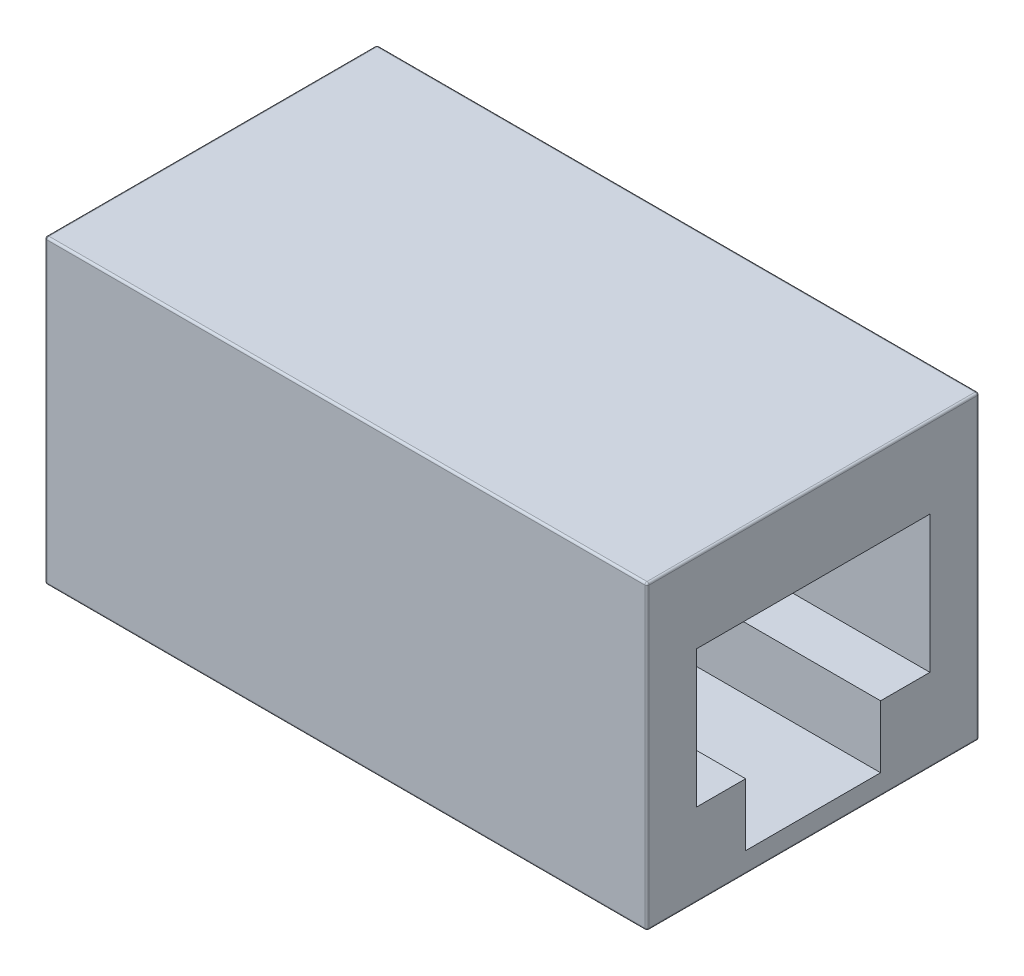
ISO-10303-21;
HEADER;
FILE_DESCRIPTION(('STEP AP214'),'2;1');
FILE_NAME('part.step','',(''),(''),'','','');
FILE_SCHEMA(('AUTOMOTIVE_DESIGN { 1 0 10303 214 1 1 1 1 }'));
ENDSEC;
DATA;
#1=APPLICATION_CONTEXT('core data for automotive mechanical design processes');
#2=APPLICATION_PROTOCOL_DEFINITION('international standard','automotive_design',2000,#1);
#3=PRODUCT_CONTEXT('',#1,'mechanical');
#4=PRODUCT('Part','Part','',(#3));
#5=PRODUCT_RELATED_PRODUCT_CATEGORY('part','',(#4));
#6=PRODUCT_DEFINITION_FORMATION('','',#4);
#7=PRODUCT_DEFINITION_CONTEXT('part definition',#1,'design');
#8=PRODUCT_DEFINITION('design','',#6,#7);
#9=PRODUCT_DEFINITION_SHAPE('','',#8);
#10=(LENGTH_UNIT() NAMED_UNIT(*) SI_UNIT(.MILLI.,.METRE.));
#11=(NAMED_UNIT(*) PLANE_ANGLE_UNIT() SI_UNIT($,.RADIAN.));
#12=(NAMED_UNIT(*) SI_UNIT($,.STERADIAN.) SOLID_ANGLE_UNIT());
#13=UNCERTAINTY_MEASURE_WITH_UNIT(LENGTH_MEASURE(1.E-05),#10,'distance_accuracy_value','');
#14=(GEOMETRIC_REPRESENTATION_CONTEXT(3) GLOBAL_UNCERTAINTY_ASSIGNED_CONTEXT((#13)) GLOBAL_UNIT_ASSIGNED_CONTEXT((#10,
#11,#12)) REPRESENTATION_CONTEXT('',''));
#15=CARTESIAN_POINT('',(0.,0.,0.));
#16=DIRECTION('',(0.,0.,1.));
#17=DIRECTION('',(1.,0.,0.));
#18=AXIS2_PLACEMENT_3D('',#15,#16,#17);
#19=CARTESIAN_POINT('',(28.9,7.15,7.9));
#20=DIRECTION('',(1.,0.,0.));
#21=DIRECTION('',(0.,0.,-1.));
#22=AXIS2_PLACEMENT_3D('',#19,#20,#21);
#23=SPHERICAL_SURFACE('',#22,0.1);
#24=CARTESIAN_POINT('',(28.9,7.15,7.89999999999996));
#25=DIRECTION('',(0.,1.,0.));
#26=DIRECTION('',(0.,0.,1.));
#27=AXIS2_PLACEMENT_3D('',#24,#25,#26);
#28=CIRCLE('',#27,0.0999999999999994);
#29=CARTESIAN_POINT('',(29.,7.14999999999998,7.9));
#30=VERTEX_POINT('',#29);
#31=CARTESIAN_POINT('',(28.9,7.15,7.99999999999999));
#32=VERTEX_POINT('',#31);
#33=EDGE_CURVE('E444',#30,#32,#28,.F.);
#34=ORIENTED_EDGE('',*,*,#33,.F.);
#35=CARTESIAN_POINT('',(28.9,7.14999999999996,7.89999999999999));
#36=DIRECTION('',(0.,0.,-1.));
#37=DIRECTION('',(-1.,0.,0.));
#38=AXIS2_PLACEMENT_3D('',#35,#36,#37);
#39=CIRCLE('',#38,0.0999999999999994);
#40=CARTESIAN_POINT('',(28.9,7.24999999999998,7.89999999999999));
#41=VERTEX_POINT('',#40);
#42=EDGE_CURVE('E525',#41,#30,#39,.T.);
#43=ORIENTED_EDGE('',*,*,#42,.F.);
#44=CARTESIAN_POINT('',(28.9,7.15,7.9));
#45=DIRECTION('',(-1.,0.,0.));
#46=DIRECTION('',(0.,0.,1.));
#47=AXIS2_PLACEMENT_3D('',#44,#45,#46);
#48=CIRCLE('',#47,0.0999999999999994);
#49=EDGE_CURVE('E549',#32,#41,#48,.T.);
#50=ORIENTED_EDGE('',*,*,#49,.F.);
#51=EDGE_LOOP('',(#34,#43,#50));
#52=FACE_BOUND('',#51,.T.);
#53=ADVANCED_FACE('F17',(#52),#23,.T.);
#54=CARTESIAN_POINT('',(28.9,7.14999999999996,-7.9));
#55=DIRECTION('',(1.,0.,0.));
#56=DIRECTION('',(0.,0.,-1.));
#57=AXIS2_PLACEMENT_3D('',#54,#55,#56);
#58=SPHERICAL_SURFACE('',#57,0.1);
#59=CARTESIAN_POINT('',(28.9,7.14999999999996,-7.9));
#60=DIRECTION('',(-1.,0.,0.));
#61=DIRECTION('',(0.,0.,1.));
#62=AXIS2_PLACEMENT_3D('',#59,#60,#61);
#63=CIRCLE('',#62,0.1);
#64=CARTESIAN_POINT('',(28.9,7.24999999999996,-7.9));
#65=VERTEX_POINT('',#64);
#66=CARTESIAN_POINT('',(28.9,7.15,-8.00000000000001));
#67=VERTEX_POINT('',#66);
#68=EDGE_CURVE('E512',#65,#67,#63,.T.);
#69=ORIENTED_EDGE('',*,*,#68,.F.);
#70=CARTESIAN_POINT('',(28.9,7.14999999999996,-7.9));
#71=DIRECTION('',(0.,0.,-1.));
#72=DIRECTION('',(-1.,0.,0.));
#73=AXIS2_PLACEMENT_3D('',#70,#71,#72);
#74=CIRCLE('',#73,0.0999999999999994);
#75=CARTESIAN_POINT('',(29.,7.14999999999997,-7.9));
#76=VERTEX_POINT('',#75);
#77=EDGE_CURVE('E536',#76,#65,#74,.F.);
#78=ORIENTED_EDGE('',*,*,#77,.F.);
#79=CARTESIAN_POINT('',(28.9,7.15,-7.90000000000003));
#80=DIRECTION('',(0.,-1.,0.));
#81=DIRECTION('',(0.,0.,-1.));
#82=AXIS2_PLACEMENT_3D('',#79,#80,#81);
#83=CIRCLE('',#82,0.0999999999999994);
#84=EDGE_CURVE('E497',#67,#76,#83,.T.);
#85=ORIENTED_EDGE('',*,*,#84,.F.);
#86=EDGE_LOOP('',(#69,#78,#85));
#87=FACE_BOUND('',#86,.T.);
#88=ADVANCED_FACE('F394',(#87),#58,.T.);
#89=CARTESIAN_POINT('',(29.,7.24999999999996,7.99999999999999));
#90=DIRECTION('',(0.,-1.,0.));
#91=DIRECTION('',(0.,0.,-1.));
#92=AXIS2_PLACEMENT_3D('',#89,#90,#91);
#93=PLANE('',#92);
#94=DIRECTION('',(-1.,0.,0.));
#95=VECTOR('',#94,1.);
#96=CARTESIAN_POINT('',(29.,7.24999999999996,-7.9));
#97=LINE('',#96,#95);
#98=CARTESIAN_POINT('',(0.099999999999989,7.24999999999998,-7.9));
#99=VERTEX_POINT('',#98);
#100=EDGE_CURVE('E392',#99,#65,#97,.F.);
#101=ORIENTED_EDGE('',*,*,#100,.F.);
#102=DIRECTION('',(0.,0.,1.));
#103=VECTOR('',#102,1.);
#104=CARTESIAN_POINT('',(0.099999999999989,7.24999999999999,7.99999999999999));
#105=LINE('',#104,#103);
#106=CARTESIAN_POINT('',(0.099999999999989,7.25,7.9));
#107=VERTEX_POINT('',#106);
#108=EDGE_CURVE('E383',#107,#99,#105,.F.);
#109=ORIENTED_EDGE('',*,*,#108,.F.);
#110=DIRECTION('',(-1.,0.,0.));
#111=VECTOR('',#110,1.);
#112=CARTESIAN_POINT('',(29.,7.25,7.89999999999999));
#113=LINE('',#112,#111);
#114=EDGE_CURVE('E538',#41,#107,#113,.T.);
#115=ORIENTED_EDGE('',*,*,#114,.F.);
#116=DIRECTION('',(0.,0.,-1.));
#117=VECTOR('',#116,1.);
#118=CARTESIAN_POINT('',(28.9,7.24999999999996,7.99999999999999));
#119=LINE('',#118,#117);
#120=EDGE_CURVE('E533',#65,#41,#119,.F.);
#121=ORIENTED_EDGE('',*,*,#120,.F.);
#122=EDGE_LOOP('',(#101,#109,#115,#121));
#123=FACE_BOUND('',#122,.T.);
#124=ADVANCED_FACE('F396',(#123),#93,.F.);
#125=CARTESIAN_POINT('',(0.099999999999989,7.14999999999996,7.9));
#126=DIRECTION('',(1.,0.,0.));
#127=DIRECTION('',(0.,0.,-1.));
#128=AXIS2_PLACEMENT_3D('',#125,#126,#127);
#129=SPHERICAL_SURFACE('',#128,0.1);
#130=CARTESIAN_POINT('',(0.099999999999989,7.14999999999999,7.89999999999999));
#131=DIRECTION('',(0.,-1.,0.));
#132=DIRECTION('',(0.,0.,-1.));
#133=AXIS2_PLACEMENT_3D('',#130,#131,#132);
#134=CIRCLE('',#133,0.1);
#135=CARTESIAN_POINT('',(0.099999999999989,7.14999999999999,7.99999999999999));
#136=VERTEX_POINT('',#135);
#137=CARTESIAN_POINT('',(0.,7.14999999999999,7.9));
#138=VERTEX_POINT('',#137);
#139=EDGE_CURVE('E386',#136,#138,#134,.T.);
#140=ORIENTED_EDGE('',*,*,#139,.F.);
#141=CARTESIAN_POINT('',(0.099999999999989,7.15,7.9));
#142=DIRECTION('',(-1.,0.,0.));
#143=DIRECTION('',(0.,0.,1.));
#144=AXIS2_PLACEMENT_3D('',#141,#142,#143);
#145=CIRCLE('',#144,0.0999999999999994);
#146=EDGE_CURVE('E547',#107,#136,#145,.F.);
#147=ORIENTED_EDGE('',*,*,#146,.F.);
#148=CARTESIAN_POINT('',(0.099999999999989,7.14999999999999,7.9));
#149=DIRECTION('',(0.,0.,1.));
#150=DIRECTION('',(1.,0.,0.));
#151=AXIS2_PLACEMENT_3D('',#148,#149,#150);
#152=CIRCLE('',#151,0.1);
#153=EDGE_CURVE('E387',#138,#107,#152,.F.);
#154=ORIENTED_EDGE('',*,*,#153,.F.);
#155=EDGE_LOOP('',(#140,#147,#154));
#156=FACE_BOUND('',#155,.T.);
#157=ADVANCED_FACE('F373',(#156),#129,.T.);
#158=CARTESIAN_POINT('',(0.099999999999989,7.14999999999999,-7.9));
#159=DIRECTION('',(1.,0.,0.));
#160=DIRECTION('',(0.,0.,-1.));
#161=AXIS2_PLACEMENT_3D('',#158,#159,#160);
#162=SPHERICAL_SURFACE('',#161,0.1);
#163=CARTESIAN_POINT('',(0.099999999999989,7.14999999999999,-7.9));
#164=DIRECTION('',(0.,0.,1.));
#165=DIRECTION('',(1.,0.,0.));
#166=AXIS2_PLACEMENT_3D('',#163,#164,#165);
#167=CIRCLE('',#166,0.1);
#168=CARTESIAN_POINT('',(0.,7.14999999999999,-7.9));
#169=VERTEX_POINT('',#168);
#170=EDGE_CURVE('E495',#99,#169,#167,.T.);
#171=ORIENTED_EDGE('',*,*,#170,.F.);
#172=CARTESIAN_POINT('',(0.099999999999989,7.14999999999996,-7.9));
#173=DIRECTION('',(-1.,0.,0.));
#174=DIRECTION('',(0.,0.,1.));
#175=AXIS2_PLACEMENT_3D('',#172,#173,#174);
#176=CIRCLE('',#175,0.1);
#177=CARTESIAN_POINT('',(0.099999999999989,7.15,-8.00000000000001));
#178=VERTEX_POINT('',#177);
#179=EDGE_CURVE('E508',#178,#99,#176,.F.);
#180=ORIENTED_EDGE('',*,*,#179,.F.);
#181=CARTESIAN_POINT('',(0.099999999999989,7.14999999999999,-7.9));
#182=DIRECTION('',(0.,1.,0.));
#183=DIRECTION('',(0.,0.,1.));
#184=AXIS2_PLACEMENT_3D('',#181,#182,#183);
#185=CIRCLE('',#184,0.1);
#186=EDGE_CURVE('E185',#169,#178,#185,.F.);
#187=ORIENTED_EDGE('',*,*,#186,.F.);
#188=EDGE_LOOP('',(#171,#180,#187));
#189=FACE_BOUND('',#188,.T.);
#190=ADVANCED_FACE('F368',(#189),#162,.T.);
#191=CARTESIAN_POINT('',(29.,7.15,7.9));
#192=DIRECTION('',(-1.,0.,0.));
#193=DIRECTION('',(0.,0.,1.));
#194=AXIS2_PLACEMENT_3D('',#191,#192,#193);
#195=CYLINDRICAL_SURFACE('',#194,0.0999999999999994);
#196=ORIENTED_EDGE('',*,*,#49,.T.);
#197=ORIENTED_EDGE('',*,*,#114,.T.);
#198=ORIENTED_EDGE('',*,*,#146,.T.);
#199=DIRECTION('',(-1.,0.,0.));
#200=VECTOR('',#199,1.);
#201=CARTESIAN_POINT('',(29.,7.14999999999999,7.99999999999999));
#202=LINE('',#201,#200);
#203=EDGE_CURVE('E447',#136,#32,#202,.F.);
#204=ORIENTED_EDGE('',*,*,#203,.T.);
#205=EDGE_LOOP('',(#196,#197,#198,#204));
#206=FACE_BOUND('',#205,.T.);
#207=ADVANCED_FACE('F364',(#206),#195,.T.);
#208=CARTESIAN_POINT('',(28.9,7.14999999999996,7.99999999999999));
#209=DIRECTION('',(0.,0.,-1.));
#210=DIRECTION('',(-1.,0.,0.));
#211=AXIS2_PLACEMENT_3D('',#208,#209,#210);
#212=CYLINDRICAL_SURFACE('',#211,0.0999999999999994);
#213=ORIENTED_EDGE('',*,*,#42,.T.);
#214=DIRECTION('',(0.,0.,-1.));
#215=VECTOR('',#214,1.);
#216=CARTESIAN_POINT('',(29.,7.14999999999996,7.99999999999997));
#217=LINE('',#216,#215);
#218=EDGE_CURVE('E282',#76,#30,#217,.F.);
#219=ORIENTED_EDGE('',*,*,#218,.F.);
#220=ORIENTED_EDGE('',*,*,#77,.T.);
#221=ORIENTED_EDGE('',*,*,#120,.T.);
#222=EDGE_LOOP('',(#213,#219,#220,#221));
#223=FACE_BOUND('',#222,.T.);
#224=ADVANCED_FACE('F360',(#223),#212,.T.);
#225=CARTESIAN_POINT('',(28.9,-7.25000000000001,7.89999999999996));
#226=DIRECTION('',(0.,1.,0.));
#227=DIRECTION('',(0.,0.,1.));
#228=AXIS2_PLACEMENT_3D('',#225,#226,#227);
#229=CYLINDRICAL_SURFACE('',#228,0.0999999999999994);
#230=ORIENTED_EDGE('',*,*,#33,.T.);
#231=DIRECTION('',(0.,1.,0.));
#232=VECTOR('',#231,1.);
#233=CARTESIAN_POINT('',(28.9,7.24999999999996,7.99999999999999));
#234=LINE('',#233,#232);
#235=CARTESIAN_POINT('',(28.9,-7.15000000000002,8.));
#236=VERTEX_POINT('',#235);
#237=EDGE_CURVE('E440',#32,#236,#234,.F.);
#238=ORIENTED_EDGE('',*,*,#237,.T.);
#239=CARTESIAN_POINT('',(28.9,-7.15,7.9));
#240=DIRECTION('',(0.,-1.,0.));
#241=DIRECTION('',(1.,0.,0.));
#242=AXIS2_PLACEMENT_3D('',#239,#240,#241);
#243=CIRCLE('',#242,0.1);
#244=CARTESIAN_POINT('',(29.,-7.15000000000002,7.9));
#245=VERTEX_POINT('',#244);
#246=EDGE_CURVE('E133',#245,#236,#243,.T.);
#247=ORIENTED_EDGE('',*,*,#246,.F.);
#248=DIRECTION('',(0.,1.,0.));
#249=VECTOR('',#248,1.);
#250=CARTESIAN_POINT('',(29.,-7.25000000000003,7.9));
#251=LINE('',#250,#249);
#252=EDGE_CURVE('E280',#30,#245,#251,.F.);
#253=ORIENTED_EDGE('',*,*,#252,.F.);
#254=EDGE_LOOP('',(#230,#238,#247,#253));
#255=FACE_BOUND('',#254,.T.);
#256=ADVANCED_FACE('F356',(#255),#229,.T.);
#257=CARTESIAN_POINT('',(29.,7.14999999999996,-7.9));
#258=DIRECTION('',(-1.,0.,0.));
#259=DIRECTION('',(0.,0.,1.));
#260=AXIS2_PLACEMENT_3D('',#257,#258,#259);
#261=CYLINDRICAL_SURFACE('',#260,0.1);
#262=ORIENTED_EDGE('',*,*,#68,.T.);
#263=DIRECTION('',(1.,0.,0.));
#264=VECTOR('',#263,1.);
#265=CARTESIAN_POINT('',(29.,7.15,-8.00000000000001));
#266=LINE('',#265,#264);
#267=EDGE_CURVE('E255',#67,#178,#266,.F.);
#268=ORIENTED_EDGE('',*,*,#267,.T.);
#269=ORIENTED_EDGE('',*,*,#179,.T.);
#270=ORIENTED_EDGE('',*,*,#100,.T.);
#271=EDGE_LOOP('',(#262,#268,#269,#270));
#272=FACE_BOUND('',#271,.T.);
#273=ADVANCED_FACE('F352',(#272),#261,.T.);
#274=CARTESIAN_POINT('',(28.9,-7.25000000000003,-7.90000000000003));
#275=DIRECTION('',(0.,-1.,0.));
#276=DIRECTION('',(0.,0.,-1.));
#277=AXIS2_PLACEMENT_3D('',#274,#275,#276);
#278=CYLINDRICAL_SURFACE('',#277,0.0999999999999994);
#279=ORIENTED_EDGE('',*,*,#84,.T.);
#280=DIRECTION('',(0.,1.,0.));
#281=VECTOR('',#280,1.);
#282=CARTESIAN_POINT('',(29.,-7.25000000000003,-7.9));
#283=LINE('',#282,#281);
#284=CARTESIAN_POINT('',(29.,-7.15000000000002,-7.90000000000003));
#285=VERTEX_POINT('',#284);
#286=EDGE_CURVE('E285',#285,#76,#283,.T.);
#287=ORIENTED_EDGE('',*,*,#286,.F.);
#288=CARTESIAN_POINT('',(28.9,-7.15000000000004,-7.90000000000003));
#289=DIRECTION('',(0.,-1.,0.));
#290=DIRECTION('',(0.,0.,-1.));
#291=AXIS2_PLACEMENT_3D('',#288,#289,#290);
#292=CIRCLE('',#291,0.0999999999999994);
#293=CARTESIAN_POINT('',(28.9,-7.15000000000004,-8.00000000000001));
#294=VERTEX_POINT('',#293);
#295=EDGE_CURVE('E514',#285,#294,#292,.F.);
#296=ORIENTED_EDGE('',*,*,#295,.T.);
#297=DIRECTION('',(0.,-1.,0.));
#298=VECTOR('',#297,1.);
#299=CARTESIAN_POINT('',(28.9,7.24999999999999,-8.00000000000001));
#300=LINE('',#299,#298);
#301=EDGE_CURVE('E236',#294,#67,#300,.F.);
#302=ORIENTED_EDGE('',*,*,#301,.T.);
#303=EDGE_LOOP('',(#279,#287,#296,#302));
#304=FACE_BOUND('',#303,.T.);
#305=ADVANCED_FACE('F348',(#304),#278,.T.);
#306=CARTESIAN_POINT('',(0.099999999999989,7.14999999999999,7.99999999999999));
#307=DIRECTION('',(0.,0.,1.));
#308=DIRECTION('',(1.,0.,0.));
#309=AXIS2_PLACEMENT_3D('',#306,#307,#308);
#310=CYLINDRICAL_SURFACE('',#309,0.1);
#311=ORIENTED_EDGE('',*,*,#153,.T.);
#312=ORIENTED_EDGE('',*,*,#108,.T.);
#313=ORIENTED_EDGE('',*,*,#170,.T.);
#314=DIRECTION('',(0.,0.,-1.));
#315=VECTOR('',#314,1.);
#316=CARTESIAN_POINT('',(0.,7.14999999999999,7.99999999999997));
#317=LINE('',#316,#315);
#318=EDGE_CURVE('E206',#169,#138,#317,.F.);
#319=ORIENTED_EDGE('',*,*,#318,.T.);
#320=EDGE_LOOP('',(#311,#312,#313,#319));
#321=FACE_BOUND('',#320,.T.);
#322=ADVANCED_FACE('F344',(#321),#310,.T.);
#323=CARTESIAN_POINT('',(0.099999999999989,7.24999999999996,7.89999999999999));
#324=DIRECTION('',(0.,-1.,0.));
#325=DIRECTION('',(0.,0.,-1.));
#326=AXIS2_PLACEMENT_3D('',#323,#324,#325);
#327=CYLINDRICAL_SURFACE('',#326,0.1);
#328=ORIENTED_EDGE('',*,*,#139,.T.);
#329=DIRECTION('',(0.,1.,0.));
#330=VECTOR('',#329,1.);
#331=CARTESIAN_POINT('',(0.,-7.25000000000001,7.9));
#332=LINE('',#331,#330);
#333=CARTESIAN_POINT('',(0.,-7.15000000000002,7.89999999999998));
#334=VERTEX_POINT('',#333);
#335=EDGE_CURVE('E200',#138,#334,#332,.F.);
#336=ORIENTED_EDGE('',*,*,#335,.T.);
#337=CARTESIAN_POINT('',(0.099999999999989,-7.15000000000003,7.9));
#338=DIRECTION('',(0.,-1.,2.68796436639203E-13));
#339=DIRECTION('',(1.,0.,0.));
#340=AXIS2_PLACEMENT_3D('',#337,#338,#339);
#341=CIRCLE('',#340,0.1);
#342=CARTESIAN_POINT('',(0.099999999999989,-7.15000000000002,8.));
#343=VERTEX_POINT('',#342);
#344=EDGE_CURVE('E213',#343,#334,#341,.T.);
#345=ORIENTED_EDGE('',*,*,#344,.F.);
#346=DIRECTION('',(0.,1.,0.));
#347=VECTOR('',#346,1.);
#348=CARTESIAN_POINT('',(0.099999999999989,7.24999999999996,7.99999999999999));
#349=LINE('',#348,#347);
#350=EDGE_CURVE('E141',#343,#136,#349,.T.);
#351=ORIENTED_EDGE('',*,*,#350,.T.);
#352=EDGE_LOOP('',(#328,#336,#345,#351));
#353=FACE_BOUND('',#352,.T.);
#354=ADVANCED_FACE('F340',(#353),#327,.T.);
#355=CARTESIAN_POINT('',(0.099999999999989,7.24999999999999,-7.9));
#356=DIRECTION('',(0.,1.,0.));
#357=DIRECTION('',(0.,0.,1.));
#358=AXIS2_PLACEMENT_3D('',#355,#356,#357);
#359=CYLINDRICAL_SURFACE('',#358,0.1);
#360=ORIENTED_EDGE('',*,*,#186,.T.);
#361=DIRECTION('',(0.,-1.,0.));
#362=VECTOR('',#361,1.);
#363=CARTESIAN_POINT('',(0.099999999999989,7.24999999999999,-8.00000000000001));
#364=LINE('',#363,#362);
#365=CARTESIAN_POINT('',(0.099999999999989,-7.15000000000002,-8.));
#366=VERTEX_POINT('',#365);
#367=EDGE_CURVE('E252',#178,#366,#364,.T.);
#368=ORIENTED_EDGE('',*,*,#367,.T.);
#369=CARTESIAN_POINT('',(0.099999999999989,-7.15,-7.9));
#370=DIRECTION('',(0.,1.,0.));
#371=DIRECTION('',(1.,0.,0.));
#372=AXIS2_PLACEMENT_3D('',#369,#370,#371);
#373=CIRCLE('',#372,0.1);
#374=CARTESIAN_POINT('',(0.,-7.15000000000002,-7.9));
#375=VERTEX_POINT('',#374);
#376=EDGE_CURVE('E234',#375,#366,#373,.F.);
#377=ORIENTED_EDGE('',*,*,#376,.F.);
#378=DIRECTION('',(0.,1.,0.));
#379=VECTOR('',#378,1.);
#380=CARTESIAN_POINT('',(0.,-7.25000000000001,-7.9));
#381=LINE('',#380,#379);
#382=EDGE_CURVE('E197',#375,#169,#381,.T.);
#383=ORIENTED_EDGE('',*,*,#382,.T.);
#384=EDGE_LOOP('',(#360,#368,#377,#383));
#385=FACE_BOUND('',#384,.T.);
#386=ADVANCED_FACE('F337',(#385),#359,.T.);
#387=CARTESIAN_POINT('',(0.,3.34999999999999,-5.62500000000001));
#388=DIRECTION('',(0.,0.,-1.));
#389=DIRECTION('',(0.,1.,0.));
#390=AXIS2_PLACEMENT_3D('',#387,#388,#389);
#391=PLANE('',#390);
#392=DIRECTION('',(1.,0.,0.));
#393=VECTOR('',#392,1.);
#394=CARTESIAN_POINT('',(0.,3.34999999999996,-5.62500000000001));
#395=LINE('',#394,#393);
#396=CARTESIAN_POINT('',(29.,3.34999999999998,-5.62500000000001));
#397=VERTEX_POINT('',#396);
#398=CARTESIAN_POINT('',(0.,3.34999999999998,-5.62500000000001));
#399=VERTEX_POINT('',#398);
#400=EDGE_CURVE('E196',#397,#399,#395,.F.);
#401=ORIENTED_EDGE('',*,*,#400,.T.);
#402=DIRECTION('',(0.,1.,0.));
#403=VECTOR('',#402,1.);
#404=CARTESIAN_POINT('',(0.,-7.25000000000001,-5.62500000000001));
#405=LINE('',#404,#403);
#406=CARTESIAN_POINT('',(0.,-3.25000000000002,-5.62500000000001));
#407=VERTEX_POINT('',#406);
#408=EDGE_CURVE('E170',#399,#407,#405,.F.);
#409=ORIENTED_EDGE('',*,*,#408,.T.);
#410=DIRECTION('',(1.,0.,0.));
#411=VECTOR('',#410,1.);
#412=CARTESIAN_POINT('',(0.,-3.25,-5.62500000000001));
#413=LINE('',#412,#411);
#414=CARTESIAN_POINT('',(29.,-3.25000000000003,-5.62500000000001));
#415=VERTEX_POINT('',#414);
#416=EDGE_CURVE('E177',#407,#415,#413,.T.);
#417=ORIENTED_EDGE('',*,*,#416,.T.);
#418=DIRECTION('',(0.,1.,0.));
#419=VECTOR('',#418,1.);
#420=CARTESIAN_POINT('',(29.,-7.25000000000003,-5.62500000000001));
#421=LINE('',#420,#419);
#422=EDGE_CURVE('E273',#397,#415,#421,.F.);
#423=ORIENTED_EDGE('',*,*,#422,.F.);
#424=EDGE_LOOP('',(#401,#409,#417,#423));
#425=FACE_BOUND('',#424,.T.);
#426=ADVANCED_FACE('F195',(#425),#391,.F.);
#427=CARTESIAN_POINT('',(0.,-3.25,-5.62500000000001));
#428=DIRECTION('',(0.,-1.,0.));
#429=DIRECTION('',(0.,0.,-1.));
#430=AXIS2_PLACEMENT_3D('',#427,#428,#429);
#431=PLANE('',#430);
#432=ORIENTED_EDGE('',*,*,#416,.F.);
#433=DIRECTION('',(0.,0.,-1.));
#434=VECTOR('',#433,1.);
#435=CARTESIAN_POINT('',(0.,-3.25,7.99999999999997));
#436=LINE('',#435,#434);
#437=CARTESIAN_POINT('',(0.,-3.25,-3.25));
#438=VERTEX_POINT('',#437);
#439=EDGE_CURVE('E180',#407,#438,#436,.F.);
#440=ORIENTED_EDGE('',*,*,#439,.T.);
#441=DIRECTION('',(1.,0.,0.));
#442=VECTOR('',#441,1.);
#443=CARTESIAN_POINT('',(0.,-3.25,-3.25));
#444=LINE('',#443,#442);
#445=CARTESIAN_POINT('',(29.,-3.25000000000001,-3.25));
#446=VERTEX_POINT('',#445);
#447=EDGE_CURVE('E184',#438,#446,#444,.T.);
#448=ORIENTED_EDGE('',*,*,#447,.T.);
#449=DIRECTION('',(0.,0.,-1.));
#450=VECTOR('',#449,1.);
#451=CARTESIAN_POINT('',(29.,-3.25000000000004,7.99999999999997));
#452=LINE('',#451,#450);
#453=EDGE_CURVE('E181',#415,#446,#452,.F.);
#454=ORIENTED_EDGE('',*,*,#453,.F.);
#455=EDGE_LOOP('',(#432,#440,#448,#454));
#456=FACE_BOUND('',#455,.T.);
#457=ADVANCED_FACE('F178',(#456),#431,.F.);
#458=CARTESIAN_POINT('',(0.,-3.25,-3.25));
#459=DIRECTION('',(0.,0.,-1.));
#460=DIRECTION('',(0.,1.,0.));
#461=AXIS2_PLACEMENT_3D('',#458,#459,#460);
#462=PLANE('',#461);
#463=ORIENTED_EDGE('',*,*,#447,.F.);
#464=DIRECTION('',(0.,1.,0.));
#465=VECTOR('',#464,1.);
#466=CARTESIAN_POINT('',(0.,-7.25000000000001,-3.25));
#467=LINE('',#466,#465);
#468=CARTESIAN_POINT('',(0.,-6.25000000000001,-3.25000000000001));
#469=VERTEX_POINT('',#468);
#470=EDGE_CURVE('E193',#438,#469,#467,.F.);
#471=ORIENTED_EDGE('',*,*,#470,.T.);
#472=DIRECTION('',(1.,0.,0.));
#473=VECTOR('',#472,1.);
#474=CARTESIAN_POINT('',(0.,-6.25000000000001,-3.25000000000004));
#475=LINE('',#474,#473);
#476=CARTESIAN_POINT('',(29.,-6.25000000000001,-3.25000000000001));
#477=VERTEX_POINT('',#476);
#478=EDGE_CURVE('E478',#469,#477,#475,.T.);
#479=ORIENTED_EDGE('',*,*,#478,.T.);
#480=DIRECTION('',(0.,1.,0.));
#481=VECTOR('',#480,1.);
#482=CARTESIAN_POINT('',(29.,-7.25000000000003,-3.25));
#483=LINE('',#482,#481);
#484=EDGE_CURVE('E270',#446,#477,#483,.F.);
#485=ORIENTED_EDGE('',*,*,#484,.F.);
#486=EDGE_LOOP('',(#463,#471,#479,#485));
#487=FACE_BOUND('',#486,.T.);
#488=ADVANCED_FACE('F328',(#487),#462,.F.);
#489=CARTESIAN_POINT('',(0.,-6.25000000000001,3.24999999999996));
#490=DIRECTION('',(0.,-1.,0.));
#491=DIRECTION('',(0.,0.,-1.));
#492=AXIS2_PLACEMENT_3D('',#489,#490,#491);
#493=PLANE('',#492);
#494=ORIENTED_EDGE('',*,*,#478,.F.);
#495=DIRECTION('',(0.,0.,-1.));
#496=VECTOR('',#495,1.);
#497=CARTESIAN_POINT('',(0.,-6.25000000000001,7.99999999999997));
#498=LINE('',#497,#496);
#499=CARTESIAN_POINT('',(0.,-6.25000000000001,3.24999999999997));
#500=VERTEX_POINT('',#499);
#501=EDGE_CURVE('E474',#469,#500,#498,.F.);
#502=ORIENTED_EDGE('',*,*,#501,.T.);
#503=DIRECTION('',(1.,0.,0.));
#504=VECTOR('',#503,1.);
#505=CARTESIAN_POINT('',(0.,-6.25000000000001,3.25));
#506=LINE('',#505,#504);
#507=CARTESIAN_POINT('',(29.,-6.25000000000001,3.24999999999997));
#508=VERTEX_POINT('',#507);
#509=EDGE_CURVE('E481',#500,#508,#506,.T.);
#510=ORIENTED_EDGE('',*,*,#509,.T.);
#511=DIRECTION('',(0.,0.,-1.));
#512=VECTOR('',#511,1.);
#513=CARTESIAN_POINT('',(29.,-6.25000000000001,7.99999999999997));
#514=LINE('',#513,#512);
#515=EDGE_CURVE('E268',#477,#508,#514,.F.);
#516=ORIENTED_EDGE('',*,*,#515,.F.);
#517=EDGE_LOOP('',(#494,#502,#510,#516));
#518=FACE_BOUND('',#517,.T.);
#519=ADVANCED_FACE('F324',(#518),#493,.F.);
#520=CARTESIAN_POINT('',(0.,-3.25,3.25));
#521=DIRECTION('',(0.,0.,1.));
#522=DIRECTION('',(0.,-1.,0.));
#523=AXIS2_PLACEMENT_3D('',#520,#521,#522);
#524=PLANE('',#523);
#525=ORIENTED_EDGE('',*,*,#509,.F.);
#526=DIRECTION('',(0.,1.,0.));
#527=VECTOR('',#526,1.);
#528=CARTESIAN_POINT('',(0.,-7.25000000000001,3.24999999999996));
#529=LINE('',#528,#527);
#530=CARTESIAN_POINT('',(0.,-3.25000000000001,3.24999999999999));
#531=VERTEX_POINT('',#530);
#532=EDGE_CURVE('E471',#500,#531,#529,.T.);
#533=ORIENTED_EDGE('',*,*,#532,.T.);
#534=DIRECTION('',(1.,0.,0.));
#535=VECTOR('',#534,1.);
#536=CARTESIAN_POINT('',(0.,-3.25000000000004,3.25));
#537=LINE('',#536,#535);
#538=CARTESIAN_POINT('',(29.,-3.25000000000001,3.24999999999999));
#539=VERTEX_POINT('',#538);
#540=EDGE_CURVE('E589',#531,#539,#537,.T.);
#541=ORIENTED_EDGE('',*,*,#540,.T.);
#542=DIRECTION('',(0.,1.,0.));
#543=VECTOR('',#542,1.);
#544=CARTESIAN_POINT('',(29.,-7.25000000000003,3.24999999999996));
#545=LINE('',#544,#543);
#546=EDGE_CURVE('E266',#508,#539,#545,.T.);
#547=ORIENTED_EDGE('',*,*,#546,.F.);
#548=EDGE_LOOP('',(#525,#533,#541,#547));
#549=FACE_BOUND('',#548,.T.);
#550=ADVANCED_FACE('F320',(#549),#524,.F.);
#551=CARTESIAN_POINT('',(0.,-3.25000000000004,5.62500000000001));
#552=DIRECTION('',(0.,-1.,0.));
#553=DIRECTION('',(0.,0.,-1.));
#554=AXIS2_PLACEMENT_3D('',#551,#552,#553);
#555=PLANE('',#554);
#556=ORIENTED_EDGE('',*,*,#540,.F.);
#557=DIRECTION('',(0.,0.,-1.));
#558=VECTOR('',#557,1.);
#559=CARTESIAN_POINT('',(0.,-3.25,7.99999999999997));
#560=LINE('',#559,#558);
#561=CARTESIAN_POINT('',(0.,-3.25000000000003,5.625));
#562=VERTEX_POINT('',#561);
#563=EDGE_CURVE('E468',#531,#562,#560,.F.);
#564=ORIENTED_EDGE('',*,*,#563,.T.);
#565=DIRECTION('',(1.,0.,0.));
#566=VECTOR('',#565,1.);
#567=CARTESIAN_POINT('',(0.,-3.25000000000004,5.62499999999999));
#568=LINE('',#567,#566);
#569=CARTESIAN_POINT('',(29.,-3.25000000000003,5.625));
#570=VERTEX_POINT('',#569);
#571=EDGE_CURVE('E587',#562,#570,#568,.T.);
#572=ORIENTED_EDGE('',*,*,#571,.T.);
#573=DIRECTION('',(0.,0.,-1.));
#574=VECTOR('',#573,1.);
#575=CARTESIAN_POINT('',(29.,-3.25,7.99999999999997));
#576=LINE('',#575,#574);
#577=EDGE_CURVE('E263',#539,#570,#576,.F.);
#578=ORIENTED_EDGE('',*,*,#577,.F.);
#579=EDGE_LOOP('',(#556,#564,#572,#578));
#580=FACE_BOUND('',#579,.T.);
#581=ADVANCED_FACE('F316',(#580),#555,.F.);
#582=CARTESIAN_POINT('',(0.,3.34999999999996,5.62499999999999));
#583=DIRECTION('',(0.,0.,1.));
#584=DIRECTION('',(1.,0.,0.));
#585=AXIS2_PLACEMENT_3D('',#582,#583,#584);
#586=PLANE('',#585);
#587=ORIENTED_EDGE('',*,*,#571,.F.);
#588=DIRECTION('',(0.,1.,0.));
#589=VECTOR('',#588,1.);
#590=CARTESIAN_POINT('',(0.,-7.25000000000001,5.62500000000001));
#591=LINE('',#590,#589);
#592=CARTESIAN_POINT('',(0.,3.34999999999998,5.62499999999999));
#593=VERTEX_POINT('',#592);
#594=EDGE_CURVE('E465',#562,#593,#591,.T.);
#595=ORIENTED_EDGE('',*,*,#594,.T.);
#596=DIRECTION('',(1.,0.,0.));
#597=VECTOR('',#596,1.);
#598=CARTESIAN_POINT('',(0.,3.34999999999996,5.62499999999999));
#599=LINE('',#598,#597);
#600=CARTESIAN_POINT('',(29.,3.34999999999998,5.62499999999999));
#601=VERTEX_POINT('',#600);
#602=EDGE_CURVE('E150',#593,#601,#599,.T.);
#603=ORIENTED_EDGE('',*,*,#602,.T.);
#604=DIRECTION('',(0.,1.,0.));
#605=VECTOR('',#604,1.);
#606=CARTESIAN_POINT('',(29.,-7.25000000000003,5.62500000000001));
#607=LINE('',#606,#605);
#608=EDGE_CURVE('E278',#570,#601,#607,.T.);
#609=ORIENTED_EDGE('',*,*,#608,.F.);
#610=EDGE_LOOP('',(#587,#595,#603,#609));
#611=FACE_BOUND('',#610,.T.);
#612=ADVANCED_FACE('F313',(#611),#586,.F.);
#613=CARTESIAN_POINT('',(0.,3.34999999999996,5.62499999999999));
#614=DIRECTION('',(0.,1.,0.));
#615=DIRECTION('',(0.,0.,1.));
#616=AXIS2_PLACEMENT_3D('',#613,#614,#615);
#617=PLANE('',#616);
#618=ORIENTED_EDGE('',*,*,#602,.F.);
#619=DIRECTION('',(0.,0.,-1.));
#620=VECTOR('',#619,1.);
#621=CARTESIAN_POINT('',(0.,3.34999999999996,7.99999999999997));
#622=LINE('',#621,#620);
#623=EDGE_CURVE('E461',#593,#399,#622,.T.);
#624=ORIENTED_EDGE('',*,*,#623,.T.);
#625=ORIENTED_EDGE('',*,*,#400,.F.);
#626=DIRECTION('',(0.,0.,-1.));
#627=VECTOR('',#626,1.);
#628=CARTESIAN_POINT('',(29.,3.34999999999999,7.99999999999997));
#629=LINE('',#628,#627);
#630=EDGE_CURVE('E275',#601,#397,#629,.T.);
#631=ORIENTED_EDGE('',*,*,#630,.F.);
#632=EDGE_LOOP('',(#618,#624,#625,#631));
#633=FACE_BOUND('',#632,.T.);
#634=ADVANCED_FACE('F310',(#633),#617,.F.);
#635=CARTESIAN_POINT('',(29.,7.24999999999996,7.99999999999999));
#636=DIRECTION('',(0.,0.,-1.));
#637=DIRECTION('',(-1.,0.,0.));
#638=AXIS2_PLACEMENT_3D('',#635,#636,#637);
#639=PLANE('',#638);
#640=DIRECTION('',(-1.,0.,0.));
#641=VECTOR('',#640,1.);
#642=CARTESIAN_POINT('',(29.,-7.15000000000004,7.99999999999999));
#643=LINE('',#642,#641);
#644=EDGE_CURVE('E21',#236,#343,#643,.T.);
#645=ORIENTED_EDGE('',*,*,#644,.F.);
#646=ORIENTED_EDGE('',*,*,#237,.F.);
#647=ORIENTED_EDGE('',*,*,#203,.F.);
#648=ORIENTED_EDGE('',*,*,#350,.F.);
#649=EDGE_LOOP('',(#645,#646,#647,#648));
#650=FACE_BOUND('',#649,.T.);
#651=ADVANCED_FACE('F307',(#650),#639,.F.);
#652=CARTESIAN_POINT('',(28.9,-7.15,7.9));
#653=DIRECTION('',(1.,0.,0.));
#654=DIRECTION('',(0.,0.,-1.));
#655=AXIS2_PLACEMENT_3D('',#652,#653,#654);
#656=SPHERICAL_SURFACE('',#655,0.1);
#657=CARTESIAN_POINT('',(28.9,-7.15000000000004,7.9));
#658=DIRECTION('',(0.,0.,1.));
#659=DIRECTION('',(1.,0.,0.));
#660=AXIS2_PLACEMENT_3D('',#657,#658,#659);
#661=CIRCLE('',#660,0.0999999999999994);
#662=CARTESIAN_POINT('',(28.9,-7.25000000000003,7.89999999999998));
#663=VERTEX_POINT('',#662);
#664=EDGE_CURVE('E448',#245,#663,#661,.F.);
#665=ORIENTED_EDGE('',*,*,#664,.F.);
#666=ORIENTED_EDGE('',*,*,#246,.T.);
#667=CARTESIAN_POINT('',(28.9,-7.15,7.9));
#668=DIRECTION('',(-1.,0.,0.));
#669=DIRECTION('',(0.,0.,1.));
#670=AXIS2_PLACEMENT_3D('',#667,#668,#669);
#671=CIRCLE('',#670,0.0999999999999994);
#672=EDGE_CURVE('E432',#663,#236,#671,.T.);
#673=ORIENTED_EDGE('',*,*,#672,.F.);
#674=EDGE_LOOP('',(#665,#666,#673));
#675=FACE_BOUND('',#674,.T.);
#676=ADVANCED_FACE('F302',(#675),#656,.T.);
#677=CARTESIAN_POINT('',(29.,-7.25000000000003,7.99999999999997));
#678=DIRECTION('',(1.,0.,0.));
#679=DIRECTION('',(0.,0.,-1.));
#680=AXIS2_PLACEMENT_3D('',#677,#678,#679);
#681=PLANE('',#680);
#682=ORIENTED_EDGE('',*,*,#546,.T.);
#683=ORIENTED_EDGE('',*,*,#577,.T.);
#684=ORIENTED_EDGE('',*,*,#608,.T.);
#685=ORIENTED_EDGE('',*,*,#630,.T.);
#686=ORIENTED_EDGE('',*,*,#422,.T.);
#687=ORIENTED_EDGE('',*,*,#453,.T.);
#688=ORIENTED_EDGE('',*,*,#484,.T.);
#689=ORIENTED_EDGE('',*,*,#515,.T.);
#690=EDGE_LOOP('',(#682,#683,#684,#685,#686,#687,#688,#689));
#691=FACE_BOUND('',#690,.T.);
#692=ORIENTED_EDGE('',*,*,#252,.T.);
#693=DIRECTION('',(0.,0.,-1.));
#694=VECTOR('',#693,1.);
#695=CARTESIAN_POINT('',(29.,-7.15,7.99999999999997));
#696=LINE('',#695,#694);
#697=EDGE_CURVE('E243',#285,#245,#696,.F.);
#698=ORIENTED_EDGE('',*,*,#697,.F.);
#699=ORIENTED_EDGE('',*,*,#286,.T.);
#700=ORIENTED_EDGE('',*,*,#218,.T.);
#701=EDGE_LOOP('',(#692,#698,#699,#700));
#702=FACE_BOUND('',#701,.T.);
#703=ADVANCED_FACE('F306',(#691,#702),#681,.T.);
#704=CARTESIAN_POINT('',(29.,7.24999999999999,-8.00000000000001));
#705=DIRECTION('',(0.,0.,1.));
#706=DIRECTION('',(0.,-1.,0.));
#707=AXIS2_PLACEMENT_3D('',#704,#705,#706);
#708=PLANE('',#707);
#709=DIRECTION('',(-1.,0.,0.));
#710=VECTOR('',#709,1.);
#711=CARTESIAN_POINT('',(29.,-7.15000000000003,-8.));
#712=LINE('',#711,#710);
#713=EDGE_CURVE('E242',#366,#294,#712,.F.);
#714=ORIENTED_EDGE('',*,*,#713,.F.);
#715=ORIENTED_EDGE('',*,*,#367,.F.);
#716=ORIENTED_EDGE('',*,*,#267,.F.);
#717=ORIENTED_EDGE('',*,*,#301,.F.);
#718=EDGE_LOOP('',(#714,#715,#716,#717));
#719=FACE_BOUND('',#718,.T.);
#720=ADVANCED_FACE('F599',(#719),#708,.F.);
#721=CARTESIAN_POINT('',(28.9,-7.15000000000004,-7.9));
#722=DIRECTION('',(1.,0.,0.));
#723=DIRECTION('',(0.,0.,-1.));
#724=AXIS2_PLACEMENT_3D('',#721,#722,#723);
#725=SPHERICAL_SURFACE('',#724,0.1);
#726=CARTESIAN_POINT('',(28.9,-7.15000000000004,-7.9));
#727=DIRECTION('',(-1.,0.,0.));
#728=DIRECTION('',(0.,0.,1.));
#729=AXIS2_PLACEMENT_3D('',#726,#727,#728);
#730=CIRCLE('',#729,0.1);
#731=CARTESIAN_POINT('',(28.9,-7.25000000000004,-7.90000000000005));
#732=VERTEX_POINT('',#731);
#733=EDGE_CURVE('E260',#294,#732,#730,.T.);
#734=ORIENTED_EDGE('',*,*,#733,.F.);
#735=ORIENTED_EDGE('',*,*,#295,.F.);
#736=CARTESIAN_POINT('',(28.9,-7.15000000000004,-7.90000000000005));
#737=DIRECTION('',(0.,0.,1.));
#738=DIRECTION('',(1.,0.,0.));
#739=AXIS2_PLACEMENT_3D('',#736,#737,#738);
#740=CIRCLE('',#739,0.0999999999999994);
#741=EDGE_CURVE('E449',#732,#285,#740,.T.);
#742=ORIENTED_EDGE('',*,*,#741,.F.);
#743=EDGE_LOOP('',(#734,#735,#742));
#744=FACE_BOUND('',#743,.T.);
#745=ADVANCED_FACE('F226',(#744),#725,.T.);
#746=CARTESIAN_POINT('',(0.099999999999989,-7.15,-7.9));
#747=DIRECTION('',(1.,0.,0.));
#748=DIRECTION('',(0.,0.,-1.));
#749=AXIS2_PLACEMENT_3D('',#746,#747,#748);
#750=SPHERICAL_SURFACE('',#749,0.1);
#751=CARTESIAN_POINT('',(0.099999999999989,-7.15,-7.9));
#752=DIRECTION('',(0.,0.,-1.));
#753=DIRECTION('',(-1.,0.,0.));
#754=AXIS2_PLACEMENT_3D('',#751,#752,#753);
#755=CIRCLE('',#754,0.1);
#756=CARTESIAN_POINT('',(0.099999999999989,-7.25000000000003,-7.90000000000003));
#757=VERTEX_POINT('',#756);
#758=EDGE_CURVE('E35',#375,#757,#755,.F.);
#759=ORIENTED_EDGE('',*,*,#758,.F.);
#760=ORIENTED_EDGE('',*,*,#376,.T.);
#761=CARTESIAN_POINT('',(0.099999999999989,-7.15000000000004,-7.9));
#762=DIRECTION('',(-1.,0.,0.));
#763=DIRECTION('',(0.,0.,1.));
#764=AXIS2_PLACEMENT_3D('',#761,#762,#763);
#765=CIRCLE('',#764,0.1);
#766=EDGE_CURVE('E239',#757,#366,#765,.F.);
#767=ORIENTED_EDGE('',*,*,#766,.F.);
#768=EDGE_LOOP('',(#759,#760,#767));
#769=FACE_BOUND('',#768,.T.);
#770=ADVANCED_FACE('F220',(#769),#750,.T.);
#771=CARTESIAN_POINT('',(0.099999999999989,-7.15000000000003,7.9));
#772=DIRECTION('',(1.,0.,0.));
#773=DIRECTION('',(0.,0.,-1.));
#774=AXIS2_PLACEMENT_3D('',#771,#772,#773);
#775=SPHERICAL_SURFACE('',#774,0.1);
#776=CARTESIAN_POINT('',(0.099999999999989,-7.15,7.89999999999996));
#777=DIRECTION('',(0.,0.,-1.));
#778=DIRECTION('',(-1.,0.,0.));
#779=AXIS2_PLACEMENT_3D('',#776,#777,#778);
#780=CIRCLE('',#779,0.1);
#781=CARTESIAN_POINT('',(0.099999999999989,-7.25000000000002,7.89999999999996));
#782=VERTEX_POINT('',#781);
#783=EDGE_CURVE('E562',#782,#334,#780,.T.);
#784=ORIENTED_EDGE('',*,*,#783,.F.);
#785=CARTESIAN_POINT('',(0.099999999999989,-7.15,7.9));
#786=DIRECTION('',(-1.,0.,0.));
#787=DIRECTION('',(0.,0.,1.));
#788=AXIS2_PLACEMENT_3D('',#785,#786,#787);
#789=CIRCLE('',#788,0.0999999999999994);
#790=EDGE_CURVE('E437',#343,#782,#789,.F.);
#791=ORIENTED_EDGE('',*,*,#790,.F.);
#792=ORIENTED_EDGE('',*,*,#344,.T.);
#793=EDGE_LOOP('',(#784,#791,#792));
#794=FACE_BOUND('',#793,.T.);
#795=ADVANCED_FACE('F216',(#794),#775,.T.);
#796=CARTESIAN_POINT('',(0.,-7.25000000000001,7.99999999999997));
#797=DIRECTION('',(1.,0.,0.));
#798=DIRECTION('',(0.,0.,-1.));
#799=AXIS2_PLACEMENT_3D('',#796,#797,#798);
#800=PLANE('',#799);
#801=ORIENTED_EDGE('',*,*,#594,.F.);
#802=ORIENTED_EDGE('',*,*,#563,.F.);
#803=ORIENTED_EDGE('',*,*,#532,.F.);
#804=ORIENTED_EDGE('',*,*,#501,.F.);
#805=ORIENTED_EDGE('',*,*,#470,.F.);
#806=ORIENTED_EDGE('',*,*,#439,.F.);
#807=ORIENTED_EDGE('',*,*,#408,.F.);
#808=ORIENTED_EDGE('',*,*,#623,.F.);
#809=EDGE_LOOP('',(#801,#802,#803,#804,#805,#806,#807,#808));
#810=FACE_BOUND('',#809,.T.);
#811=DIRECTION('',(0.,0.,-1.));
#812=VECTOR('',#811,1.);
#813=CARTESIAN_POINT('',(0.,-7.15000000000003,7.99999999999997));
#814=LINE('',#813,#812);
#815=EDGE_CURVE('E561',#334,#375,#814,.T.);
#816=ORIENTED_EDGE('',*,*,#815,.F.);
#817=ORIENTED_EDGE('',*,*,#335,.F.);
#818=ORIENTED_EDGE('',*,*,#318,.F.);
#819=ORIENTED_EDGE('',*,*,#382,.F.);
#820=EDGE_LOOP('',(#816,#817,#818,#819));
#821=FACE_BOUND('',#820,.T.);
#822=ADVANCED_FACE('F189',(#810,#821),#800,.F.);
#823=CARTESIAN_POINT('',(29.,-7.15,7.9));
#824=DIRECTION('',(-1.,0.,0.));
#825=DIRECTION('',(0.,0.,1.));
#826=AXIS2_PLACEMENT_3D('',#823,#824,#825);
#827=CYLINDRICAL_SURFACE('',#826,0.0999999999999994);
#828=ORIENTED_EDGE('',*,*,#672,.T.);
#829=ORIENTED_EDGE('',*,*,#644,.T.);
#830=ORIENTED_EDGE('',*,*,#790,.T.);
#831=DIRECTION('',(1.,0.,0.));
#832=VECTOR('',#831,1.);
#833=CARTESIAN_POINT('',(29.,-7.25000000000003,7.89999999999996));
#834=LINE('',#833,#832);
#835=EDGE_CURVE('E295',#782,#663,#834,.T.);
#836=ORIENTED_EDGE('',*,*,#835,.T.);
#837=EDGE_LOOP('',(#828,#829,#830,#836));
#838=FACE_BOUND('',#837,.T.);
#839=ADVANCED_FACE('F423',(#838),#827,.T.);
#840=CARTESIAN_POINT('',(28.9,-7.15000000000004,8.00000000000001));
#841=DIRECTION('',(0.,0.,1.));
#842=DIRECTION('',(1.,0.,0.));
#843=AXIS2_PLACEMENT_3D('',#840,#841,#842);
#844=CYLINDRICAL_SURFACE('',#843,0.0999999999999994);
#845=ORIENTED_EDGE('',*,*,#741,.T.);
#846=ORIENTED_EDGE('',*,*,#697,.T.);
#847=ORIENTED_EDGE('',*,*,#664,.T.);
#848=DIRECTION('',(0.,0.,1.));
#849=VECTOR('',#848,1.);
#850=CARTESIAN_POINT('',(28.9,-7.25000000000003,7.99999999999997));
#851=LINE('',#850,#849);
#852=EDGE_CURVE('E248',#663,#732,#851,.F.);
#853=ORIENTED_EDGE('',*,*,#852,.T.);
#854=EDGE_LOOP('',(#845,#846,#847,#853));
#855=FACE_BOUND('',#854,.T.);
#856=ADVANCED_FACE('F420',(#855),#844,.T.);
#857=CARTESIAN_POINT('',(29.,-7.15000000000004,-7.9));
#858=DIRECTION('',(-1.,0.,0.));
#859=DIRECTION('',(0.,0.,1.));
#860=AXIS2_PLACEMENT_3D('',#857,#858,#859);
#861=CYLINDRICAL_SURFACE('',#860,0.1);
#862=ORIENTED_EDGE('',*,*,#733,.T.);
#863=DIRECTION('',(1.,0.,0.));
#864=VECTOR('',#863,1.);
#865=CARTESIAN_POINT('',(29.,-7.25000000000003,-7.90000000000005));
#866=LINE('',#865,#864);
#867=EDGE_CURVE('E27',#732,#757,#866,.F.);
#868=ORIENTED_EDGE('',*,*,#867,.T.);
#869=ORIENTED_EDGE('',*,*,#766,.T.);
#870=ORIENTED_EDGE('',*,*,#713,.T.);
#871=EDGE_LOOP('',(#862,#868,#869,#870));
#872=FACE_BOUND('',#871,.T.);
#873=ADVANCED_FACE('F414',(#872),#861,.T.);
#874=CARTESIAN_POINT('',(0.099999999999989,-7.15,7.99999999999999));
#875=DIRECTION('',(0.,0.,-1.));
#876=DIRECTION('',(-1.,0.,0.));
#877=AXIS2_PLACEMENT_3D('',#874,#875,#876);
#878=CYLINDRICAL_SURFACE('',#877,0.1);
#879=ORIENTED_EDGE('',*,*,#783,.T.);
#880=ORIENTED_EDGE('',*,*,#815,.T.);
#881=ORIENTED_EDGE('',*,*,#758,.T.);
#882=DIRECTION('',(0.,0.,1.));
#883=VECTOR('',#882,1.);
#884=CARTESIAN_POINT('',(0.099999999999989,-7.25000000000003,7.99999999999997));
#885=LINE('',#884,#883);
#886=EDGE_CURVE('E11',#757,#782,#885,.T.);
#887=ORIENTED_EDGE('',*,*,#886,.T.);
#888=EDGE_LOOP('',(#879,#880,#881,#887));
#889=FACE_BOUND('',#888,.T.);
#890=ADVANCED_FACE('F408',(#889),#878,.T.);
#891=CARTESIAN_POINT('',(29.,-7.25000000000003,7.99999999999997));
#892=DIRECTION('',(0.,1.,0.));
#893=DIRECTION('',(0.,0.,1.));
#894=AXIS2_PLACEMENT_3D('',#891,#892,#893);
#895=PLANE('',#894);
#896=ORIENTED_EDGE('',*,*,#867,.F.);
#897=ORIENTED_EDGE('',*,*,#852,.F.);
#898=ORIENTED_EDGE('',*,*,#835,.F.);
#899=ORIENTED_EDGE('',*,*,#886,.F.);
#900=EDGE_LOOP('',(#896,#897,#898,#899));
#901=FACE_BOUND('',#900,.T.);
#902=ADVANCED_FACE('F406',(#901),#895,.F.);
#903=CLOSED_SHELL('',(#53,#88,#124,#157,#190,#207,#224,#256,#273,#305,#322,#354,#386,#426,#457,
#488,#519,#550,#581,#612,#634,#651,#676,#703,#720,#745,#770,#795,#822,#839,#856,#873,#890,#902));
#904=MANIFOLD_SOLID_BREP('B1',#903);
#905=ADVANCED_BREP_SHAPE_REPRESENTATION('',(#18,#904),#14);
#906=SHAPE_DEFINITION_REPRESENTATION(#9,#905);
ENDSEC;
END-ISO-10303-21;
